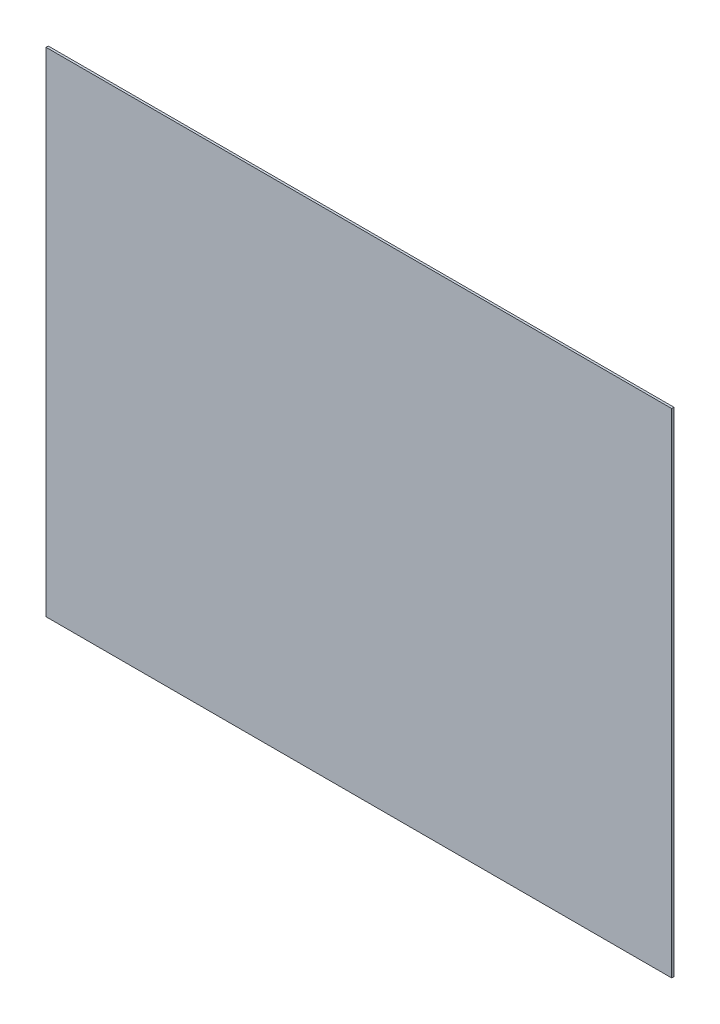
from build123d import *

# Parameters (mm, degrees)
SKETCH1_W           = 67000
SKETCH1_H           = 85000
BOSS_EXTRUDE1_DEPTH = 304.8


with BuildPart() as part:
    # Sketch1 → Boss-Extrude1 (new body)
    with BuildSketch(Plane(origin=(0, 0, 0), x_dir=(0, 1, 0), z_dir=(0, 0, 1))):
        Rectangle(SKETCH1_W, SKETCH1_H)
    extrude(amount=BOSS_EXTRUDE1_DEPTH)


solid = part.part
